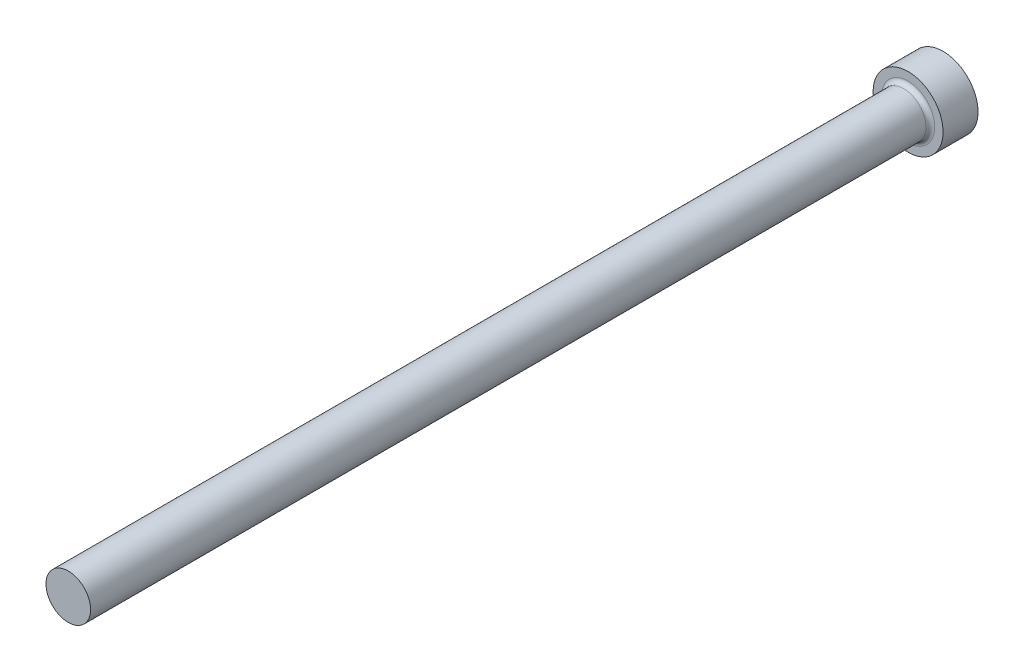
ISO-10303-21;
HEADER;
FILE_DESCRIPTION(('STEP AP214'),'2;1');
FILE_NAME('part.step','',(''),(''),'','','');
FILE_SCHEMA(('AUTOMOTIVE_DESIGN { 1 0 10303 214 1 1 1 1 }'));
ENDSEC;
DATA;
#1=APPLICATION_CONTEXT('core data for automotive mechanical design processes');
#2=APPLICATION_PROTOCOL_DEFINITION('international standard','automotive_design',2000,#1);
#3=PRODUCT_CONTEXT('',#1,'mechanical');
#4=PRODUCT('Part','Part','',(#3));
#5=PRODUCT_RELATED_PRODUCT_CATEGORY('part','',(#4));
#6=PRODUCT_DEFINITION_FORMATION('','',#4);
#7=PRODUCT_DEFINITION_CONTEXT('part definition',#1,'design');
#8=PRODUCT_DEFINITION('design','',#6,#7);
#9=PRODUCT_DEFINITION_SHAPE('','',#8);
#10=(LENGTH_UNIT() NAMED_UNIT(*) SI_UNIT(.MILLI.,.METRE.));
#11=(NAMED_UNIT(*) PLANE_ANGLE_UNIT() SI_UNIT($,.RADIAN.));
#12=(NAMED_UNIT(*) SI_UNIT($,.STERADIAN.) SOLID_ANGLE_UNIT());
#13=UNCERTAINTY_MEASURE_WITH_UNIT(LENGTH_MEASURE(1.E-05),#10,'distance_accuracy_value','');
#14=(GEOMETRIC_REPRESENTATION_CONTEXT(3) GLOBAL_UNCERTAINTY_ASSIGNED_CONTEXT((#13)) GLOBAL_UNIT_ASSIGNED_CONTEXT((#10,
#11,#12)) REPRESENTATION_CONTEXT('',''));
#15=CARTESIAN_POINT('',(0.,0.,0.));
#16=DIRECTION('',(0.,0.,1.));
#17=DIRECTION('',(1.,0.,0.));
#18=AXIS2_PLACEMENT_3D('',#15,#16,#17);
#19=CARTESIAN_POINT('',(4.,0.,4.));
#20=DIRECTION('',(0.,0.,-1.));
#21=DIRECTION('',(-1.,0.,0.));
#22=AXIS2_PLACEMENT_3D('',#19,#20,#21);
#23=PLANE('',#22);
#24=CARTESIAN_POINT('',(0.,0.,4.));
#25=DIRECTION('',(0.,0.,-1.));
#26=DIRECTION('',(-1.,0.,0.));
#27=AXIS2_PLACEMENT_3D('',#24,#25,#26);
#28=CIRCLE('',#27,3.05000000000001);
#29=CARTESIAN_POINT('',(-3.05000000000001,0.,4.));
#30=VERTEX_POINT('',#29);
#31=EDGE_CURVE('E40',#30,#30,#28,.T.);
#32=ORIENTED_EDGE('',*,*,#31,.T.);
#33=EDGE_LOOP('',(#32));
#34=FACE_BOUND('',#33,.T.);
#35=CARTESIAN_POINT('',(0.,0.,4.));
#36=DIRECTION('',(0.,0.,-1.));
#37=DIRECTION('',(-1.,0.,0.));
#38=AXIS2_PLACEMENT_3D('',#35,#36,#37);
#39=CIRCLE('',#38,4.);
#40=CARTESIAN_POINT('',(-4.,0.,4.));
#41=VERTEX_POINT('',#40);
#42=EDGE_CURVE('E44',#41,#41,#39,.T.);
#43=ORIENTED_EDGE('',*,*,#42,.F.);
#44=EDGE_LOOP('',(#43));
#45=FACE_BOUND('',#44,.T.);
#46=ADVANCED_FACE('F33',(#34,#45),#23,.F.);
#47=CARTESIAN_POINT('',(0.,0.,-9.03322817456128));
#48=DIRECTION('',(0.,0.,-1.));
#49=DIRECTION('',(-1.,0.,0.));
#50=AXIS2_PLACEMENT_3D('',#47,#48,#49);
#51=CYLINDRICAL_SURFACE('',#50,4.);
#52=CARTESIAN_POINT('',(0.,0.,0.));
#53=DIRECTION('',(0.,0.,-1.));
#54=DIRECTION('',(-1.,0.,0.));
#55=AXIS2_PLACEMENT_3D('',#52,#53,#54);
#56=CIRCLE('',#55,4.);
#57=CARTESIAN_POINT('',(-4.,0.,0.));
#58=VERTEX_POINT('',#57);
#59=EDGE_CURVE('E48',#58,#58,#56,.T.);
#60=ORIENTED_EDGE('',*,*,#59,.F.);
#61=EDGE_LOOP('',(#60));
#62=FACE_BOUND('',#61,.T.);
#63=ORIENTED_EDGE('',*,*,#42,.T.);
#64=EDGE_LOOP('',(#63));
#65=FACE_BOUND('',#64,.T.);
#66=ADVANCED_FACE('F68',(#62,#65),#51,.T.);
#67=CARTESIAN_POINT('',(0.,0.,0.));
#68=DIRECTION('',(0.,0.,1.));
#69=DIRECTION('',(1.,0.,0.));
#70=AXIS2_PLACEMENT_3D('',#67,#68,#69);
#71=PLANE('',#70);
#72=ORIENTED_EDGE('',*,*,#59,.T.);
#73=EDGE_LOOP('',(#72));
#74=FACE_BOUND('',#73,.T.);
#75=ADVANCED_FACE('F61',(#74),#71,.F.);
#76=CARTESIAN_POINT('',(0.,0.,100.));
#77=DIRECTION('',(0.,0.,-1.));
#78=DIRECTION('',(-1.,0.,0.));
#79=AXIS2_PLACEMENT_3D('',#76,#77,#78);
#80=PLANE('',#79);
#81=CARTESIAN_POINT('',(0.,0.,100.));
#82=DIRECTION('',(0.,0.,-1.));
#83=DIRECTION('',(-1.,0.,0.));
#84=AXIS2_PLACEMENT_3D('',#81,#82,#83);
#85=CIRCLE('',#84,2.55000000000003);
#86=CARTESIAN_POINT('',(-2.55000000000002,0.,100.));
#87=VERTEX_POINT('',#86);
#88=EDGE_CURVE('E53',#87,#87,#85,.T.);
#89=ORIENTED_EDGE('',*,*,#88,.F.);
#90=EDGE_LOOP('',(#89));
#91=FACE_BOUND('',#90,.T.);
#92=ADVANCED_FACE('F59',(#91),#80,.F.);
#93=CARTESIAN_POINT('',(0.,0.,-9.03322817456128));
#94=DIRECTION('',(0.,0.,-1.));
#95=DIRECTION('',(-1.,0.,0.));
#96=AXIS2_PLACEMENT_3D('',#93,#94,#95);
#97=CYLINDRICAL_SURFACE('',#96,2.55000000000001);
#98=CARTESIAN_POINT('',(0.,0.,4.5));
#99=DIRECTION('',(0.,0.,-1.));
#100=DIRECTION('',(-1.,0.,0.));
#101=AXIS2_PLACEMENT_3D('',#98,#99,#100);
#102=CIRCLE('',#101,2.55000000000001);
#103=CARTESIAN_POINT('',(-2.55000000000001,0.,4.5));
#104=VERTEX_POINT('',#103);
#105=EDGE_CURVE('E10',#104,#104,#102,.F.);
#106=ORIENTED_EDGE('',*,*,#105,.T.);
#107=EDGE_LOOP('',(#106));
#108=FACE_BOUND('',#107,.T.);
#109=ORIENTED_EDGE('',*,*,#88,.T.);
#110=EDGE_LOOP('',(#109));
#111=FACE_BOUND('',#110,.T.);
#112=ADVANCED_FACE('F57',(#108,#111),#97,.T.);
#113=CARTESIAN_POINT('',(0.,0.,4.5));
#114=DIRECTION('',(0.,0.,-1.));
#115=DIRECTION('',(-1.,0.,0.));
#116=AXIS2_PLACEMENT_3D('',#113,#114,#115);
#117=TOROIDAL_SURFACE('',#116,3.05000000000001,0.5);
#118=ORIENTED_EDGE('',*,*,#105,.F.);
#119=EDGE_LOOP('',(#118));
#120=FACE_BOUND('',#119,.T.);
#121=ORIENTED_EDGE('',*,*,#31,.F.);
#122=EDGE_LOOP('',(#121));
#123=FACE_BOUND('',#122,.T.);
#124=ADVANCED_FACE('F35',(#120,#123),#117,.F.);
#125=CLOSED_SHELL('',(#46,#66,#75,#92,#112,#124));
#126=MANIFOLD_SOLID_BREP('B2',#125);
#127=ADVANCED_BREP_SHAPE_REPRESENTATION('',(#18,#126),#14);
#128=SHAPE_DEFINITION_REPRESENTATION(#9,#127);
ENDSEC;
END-ISO-10303-21;
